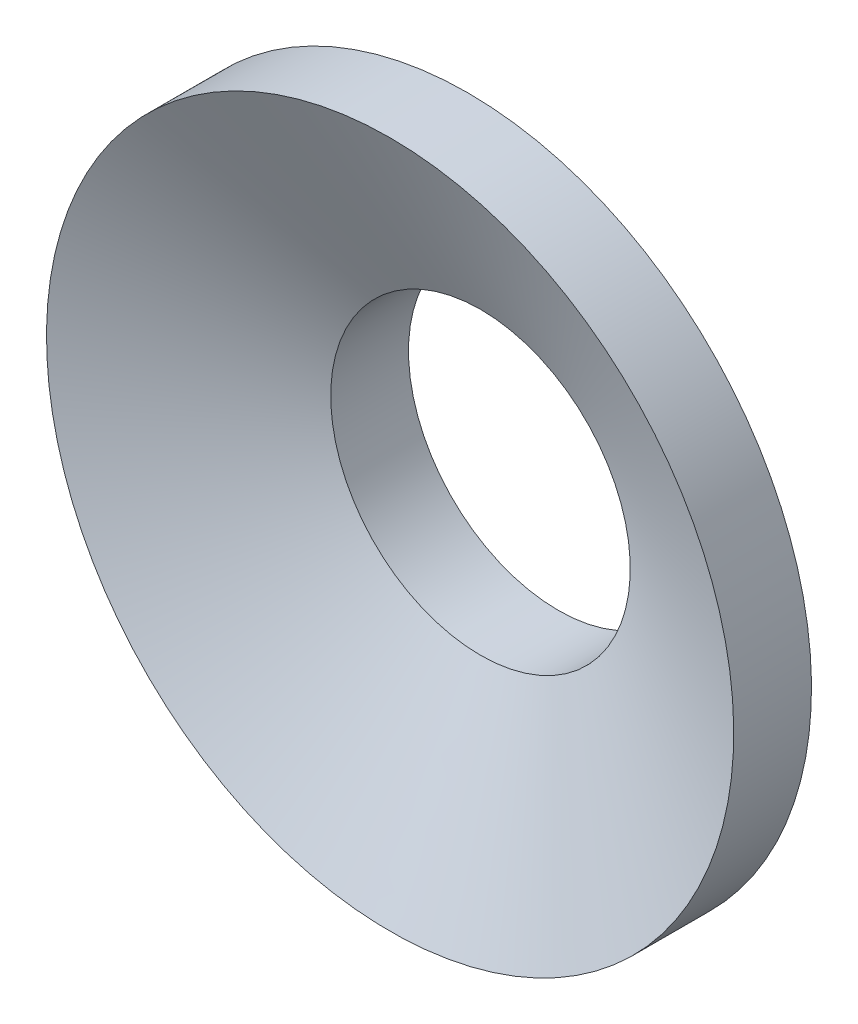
ISO-10303-21;
HEADER;
FILE_DESCRIPTION(('STEP AP214'),'2;1');
FILE_NAME('part.step','',(''),(''),'','','');
FILE_SCHEMA(('AUTOMOTIVE_DESIGN { 1 0 10303 214 1 1 1 1 }'));
ENDSEC;
DATA;
#1=APPLICATION_CONTEXT('core data for automotive mechanical design processes');
#2=APPLICATION_PROTOCOL_DEFINITION('international standard','automotive_design',2000,#1);
#3=PRODUCT_CONTEXT('',#1,'mechanical');
#4=PRODUCT('Part','Part','',(#3));
#5=PRODUCT_RELATED_PRODUCT_CATEGORY('part','',(#4));
#6=PRODUCT_DEFINITION_FORMATION('','',#4);
#7=PRODUCT_DEFINITION_CONTEXT('part definition',#1,'design');
#8=PRODUCT_DEFINITION('design','',#6,#7);
#9=PRODUCT_DEFINITION_SHAPE('','',#8);
#10=(LENGTH_UNIT() NAMED_UNIT(*) SI_UNIT(.MILLI.,.METRE.));
#11=(NAMED_UNIT(*) PLANE_ANGLE_UNIT() SI_UNIT($,.RADIAN.));
#12=(NAMED_UNIT(*) SI_UNIT($,.STERADIAN.) SOLID_ANGLE_UNIT());
#13=UNCERTAINTY_MEASURE_WITH_UNIT(LENGTH_MEASURE(1.E-05),#10,'distance_accuracy_value','');
#14=(GEOMETRIC_REPRESENTATION_CONTEXT(3) GLOBAL_UNCERTAINTY_ASSIGNED_CONTEXT((#13)) GLOBAL_UNIT_ASSIGNED_CONTEXT((#10,
#11,#12)) REPRESENTATION_CONTEXT('',''));
#15=CARTESIAN_POINT('',(0.,0.,0.));
#16=DIRECTION('',(0.,0.,1.));
#17=DIRECTION('',(1.,0.,0.));
#18=AXIS2_PLACEMENT_3D('',#15,#16,#17);
#19=DIRECTION('',(0.,0.90630778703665,0.4226182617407));
#20=VECTOR('',#19,1.);
#21=CARTESIAN_POINT('',(0.,14.,6.97820379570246));
#22=LINE('',#21,#20);
#23=CARTESIAN_POINT('',(0.,0.,0.449896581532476));
#24=DIRECTION('',(0.,0.,1.));
#25=AXIS1_PLACEMENT('',#23,#24);
#26=SURFACE_OF_REVOLUTION('',#22,#25);
#27=CARTESIAN_POINT('',(0.,0.,4.41351167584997));
#28=DIRECTION('',(0.,0.,1.));
#29=DIRECTION('',(0.,1.,0.));
#30=AXIS2_PLACEMENT_3D('',#27,#28,#29);
#31=CIRCLE('',#30,8.5);
#32=CARTESIAN_POINT('',(0.,8.5,4.41351167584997));
#33=VERTEX_POINT('',#32);
#34=EDGE_CURVE('E23',#33,#33,#31,.T.);
#35=ORIENTED_EDGE('',*,*,#34,.F.);
#36=EDGE_LOOP('',(#35));
#37=FACE_BOUND('',#36,.T.);
#38=CARTESIAN_POINT('',(0.,0.,9.54289591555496));
#39=DIRECTION('',(0.,0.,1.));
#40=DIRECTION('',(0.,1.,0.));
#41=AXIS2_PLACEMENT_3D('',#38,#39,#40);
#42=CIRCLE('',#41,19.5);
#43=CARTESIAN_POINT('',(0.,19.5,9.54289591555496));
#44=VERTEX_POINT('',#43);
#45=EDGE_CURVE('E31',#44,#44,#42,.T.);
#46=ORIENTED_EDGE('',*,*,#45,.T.);
#47=EDGE_LOOP('',(#46));
#48=FACE_BOUND('',#47,.T.);
#49=ADVANCED_FACE('F15',(#37,#48),#26,.F.);
#50=CARTESIAN_POINT('',(0.,0.,7.33614007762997));
#51=DIRECTION('',(0.,0.,1.));
#52=DIRECTION('',(1.,0.,0.));
#53=AXIS2_PLACEMENT_3D('',#50,#51,#52);
#54=CYLINDRICAL_SURFACE('',#53,19.5);
#55=CARTESIAN_POINT('',(0.,0.,5.12938423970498));
#56=DIRECTION('',(0.,0.,1.));
#57=DIRECTION('',(0.,1.,0.));
#58=AXIS2_PLACEMENT_3D('',#55,#56,#57);
#59=CIRCLE('',#58,19.5);
#60=CARTESIAN_POINT('',(0.,19.5,5.12938423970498));
#61=VERTEX_POINT('',#60);
#62=EDGE_CURVE('E28',#61,#61,#59,.T.);
#63=ORIENTED_EDGE('',*,*,#62,.T.);
#64=EDGE_LOOP('',(#63));
#65=FACE_BOUND('',#64,.T.);
#66=ORIENTED_EDGE('',*,*,#45,.F.);
#67=EDGE_LOOP('',(#66));
#68=FACE_BOUND('',#67,.T.);
#69=ADVANCED_FACE('F41',(#65,#68),#54,.T.);
#70=DIRECTION('',(0.,-0.90630778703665,-0.422618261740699));
#71=VECTOR('',#70,1.);
#72=CARTESIAN_POINT('',(0.,14.,2.56469211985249));
#73=LINE('',#72,#71);
#74=CARTESIAN_POINT('',(0.,0.,-3.96361509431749));
#75=DIRECTION('',(0.,0.,1.));
#76=AXIS1_PLACEMENT('',#74,#75);
#77=SURFACE_OF_REVOLUTION('',#73,#76);
#78=CARTESIAN_POINT('',(0.,0.,0.));
#79=DIRECTION('',(0.,0.,1.));
#80=DIRECTION('',(0.,1.,0.));
#81=AXIS2_PLACEMENT_3D('',#78,#79,#80);
#82=CIRCLE('',#81,8.5);
#83=CARTESIAN_POINT('',(0.,8.5,0.));
#84=VERTEX_POINT('',#83);
#85=EDGE_CURVE('E10',#84,#84,#82,.T.);
#86=ORIENTED_EDGE('',*,*,#85,.T.);
#87=EDGE_LOOP('',(#86));
#88=FACE_BOUND('',#87,.T.);
#89=ORIENTED_EDGE('',*,*,#62,.F.);
#90=EDGE_LOOP('',(#89));
#91=FACE_BOUND('',#90,.T.);
#92=ADVANCED_FACE('F44',(#88,#91),#77,.F.);
#93=CARTESIAN_POINT('',(0.,0.,2.20675583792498));
#94=DIRECTION('',(0.,0.,-1.));
#95=DIRECTION('',(0.,1.,0.));
#96=AXIS2_PLACEMENT_3D('',#93,#94,#95);
#97=CIRCLE('',#96,8.5);
#98=DIRECTION('',(0.,0.,1.));
#99=VECTOR('',#98,1.);
#100=SURFACE_OF_LINEAR_EXTRUSION('',#97,#99);
#101=ORIENTED_EDGE('',*,*,#85,.F.);
#102=EDGE_LOOP('',(#101));
#103=FACE_BOUND('',#102,.T.);
#104=ORIENTED_EDGE('',*,*,#34,.T.);
#105=EDGE_LOOP('',(#104));
#106=FACE_BOUND('',#105,.T.);
#107=ADVANCED_FACE('F17',(#103,#106),#100,.T.);
#108=CLOSED_SHELL('',(#49,#69,#92,#107));
#109=MANIFOLD_SOLID_BREP('B1',#108);
#110=ADVANCED_BREP_SHAPE_REPRESENTATION('',(#18,#109),#14);
#111=SHAPE_DEFINITION_REPRESENTATION(#9,#110);
ENDSEC;
END-ISO-10303-21;
